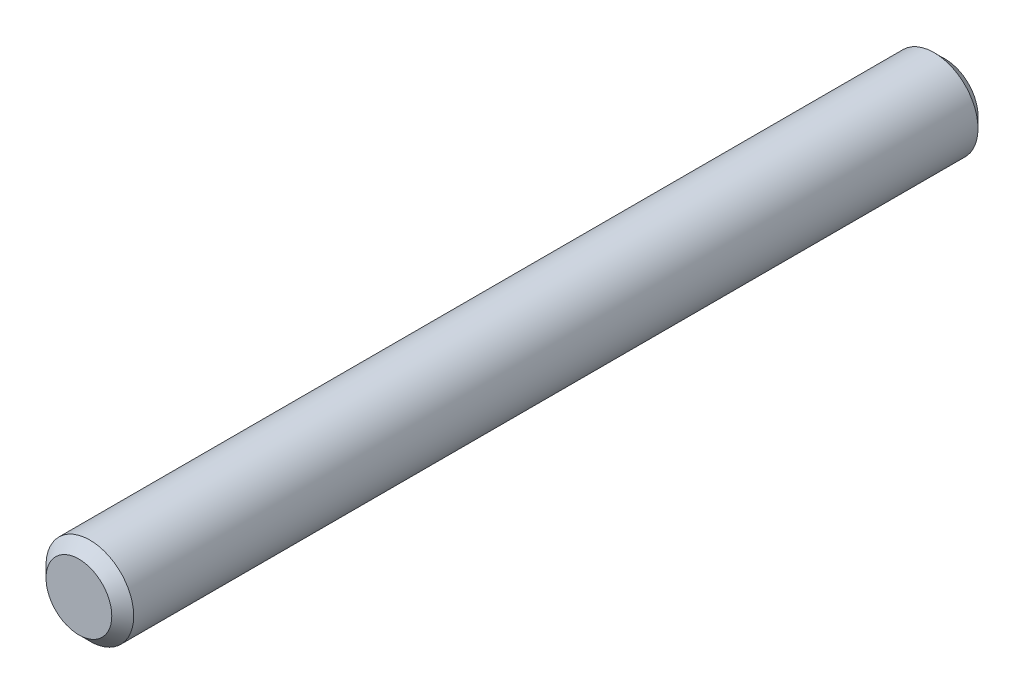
ISO-10303-21;
HEADER;
FILE_DESCRIPTION(('STEP AP214'),'2;1');
FILE_NAME('part.step','',(''),(''),'','','');
FILE_SCHEMA(('AUTOMOTIVE_DESIGN { 1 0 10303 214 1 1 1 1 }'));
ENDSEC;
DATA;
#1=APPLICATION_CONTEXT('core data for automotive mechanical design processes');
#2=APPLICATION_PROTOCOL_DEFINITION('international standard','automotive_design',2000,#1);
#3=PRODUCT_CONTEXT('',#1,'mechanical');
#4=PRODUCT('Part','Part','',(#3));
#5=PRODUCT_RELATED_PRODUCT_CATEGORY('part','',(#4));
#6=PRODUCT_DEFINITION_FORMATION('','',#4);
#7=PRODUCT_DEFINITION_CONTEXT('part definition',#1,'design');
#8=PRODUCT_DEFINITION('design','',#6,#7);
#9=PRODUCT_DEFINITION_SHAPE('','',#8);
#10=(LENGTH_UNIT() NAMED_UNIT(*) SI_UNIT(.MILLI.,.METRE.));
#11=(NAMED_UNIT(*) PLANE_ANGLE_UNIT() SI_UNIT($,.RADIAN.));
#12=(NAMED_UNIT(*) SI_UNIT($,.STERADIAN.) SOLID_ANGLE_UNIT());
#13=UNCERTAINTY_MEASURE_WITH_UNIT(LENGTH_MEASURE(1.E-05),#10,'distance_accuracy_value','');
#14=(GEOMETRIC_REPRESENTATION_CONTEXT(3) GLOBAL_UNCERTAINTY_ASSIGNED_CONTEXT((#13)) GLOBAL_UNIT_ASSIGNED_CONTEXT((#10,
#11,#12)) REPRESENTATION_CONTEXT('',''));
#15=CARTESIAN_POINT('',(0.,0.,0.));
#16=DIRECTION('',(0.,0.,1.));
#17=DIRECTION('',(1.,0.,0.));
#18=AXIS2_PLACEMENT_3D('',#15,#16,#17);
#19=CARTESIAN_POINT('',(16.875,12.7283573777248,17.6));
#20=DIRECTION('',(0.,0.,-1.));
#21=DIRECTION('',(-1.,0.,0.));
#22=AXIS2_PLACEMENT_3D('',#19,#20,#21);
#23=CYLINDRICAL_SURFACE('',#22,1.);
#24=CARTESIAN_POINT('',(16.875,12.7283573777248,17.35));
#25=DIRECTION('',(0.,0.,1.));
#26=DIRECTION('',(1.,0.,0.));
#27=AXIS2_PLACEMENT_3D('',#24,#25,#26);
#28=CIRCLE('',#27,1.);
#29=CARTESIAN_POINT('',(17.875,12.7283573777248,17.35));
#30=VERTEX_POINT('',#29);
#31=EDGE_CURVE('E33',#30,#30,#28,.F.);
#32=ORIENTED_EDGE('',*,*,#31,.T.);
#33=EDGE_LOOP('',(#32));
#34=FACE_BOUND('',#33,.T.);
#35=CARTESIAN_POINT('',(16.875,12.7283573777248,-1.9));
#36=DIRECTION('',(0.,0.,1.));
#37=DIRECTION('',(1.,0.,0.));
#38=AXIS2_PLACEMENT_3D('',#35,#36,#37);
#39=CIRCLE('',#38,1.);
#40=CARTESIAN_POINT('',(17.875,12.7283573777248,-1.9));
#41=VERTEX_POINT('',#40);
#42=EDGE_CURVE('E37',#41,#41,#39,.T.);
#43=ORIENTED_EDGE('',*,*,#42,.T.);
#44=EDGE_LOOP('',(#43));
#45=FACE_BOUND('',#44,.T.);
#46=ADVANCED_FACE('F27',(#34,#45),#23,.T.);
#47=CARTESIAN_POINT('',(16.875,12.7283573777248,17.6));
#48=DIRECTION('',(0.,0.,1.));
#49=DIRECTION('',(1.,0.,0.));
#50=AXIS2_PLACEMENT_3D('',#47,#48,#49);
#51=PLANE('',#50);
#52=CARTESIAN_POINT('',(16.875,12.7283573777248,17.6));
#53=DIRECTION('',(0.,0.,1.));
#54=DIRECTION('',(1.,0.,0.));
#55=AXIS2_PLACEMENT_3D('',#52,#53,#54);
#56=CIRCLE('',#55,0.750000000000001);
#57=CARTESIAN_POINT('',(17.625,12.7283573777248,17.6));
#58=VERTEX_POINT('',#57);
#59=EDGE_CURVE('E41',#58,#58,#56,.T.);
#60=ORIENTED_EDGE('',*,*,#59,.T.);
#61=EDGE_LOOP('',(#60));
#62=FACE_BOUND('',#61,.T.);
#63=ADVANCED_FACE('F47',(#62),#51,.T.);
#64=CARTESIAN_POINT('',(16.875,12.7283573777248,-2.15));
#65=DIRECTION('',(0.,0.,1.));
#66=DIRECTION('',(1.,0.,0.));
#67=AXIS2_PLACEMENT_3D('',#64,#65,#66);
#68=PLANE('',#67);
#69=CARTESIAN_POINT('',(16.875,12.7283573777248,-2.15));
#70=DIRECTION('',(0.,0.,1.));
#71=DIRECTION('',(1.,0.,0.));
#72=AXIS2_PLACEMENT_3D('',#69,#70,#71);
#73=CIRCLE('',#72,0.750000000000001);
#74=CARTESIAN_POINT('',(17.625,12.7283573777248,-2.15));
#75=VERTEX_POINT('',#74);
#76=EDGE_CURVE('E10',#75,#75,#73,.F.);
#77=ORIENTED_EDGE('',*,*,#76,.T.);
#78=EDGE_LOOP('',(#77));
#79=FACE_BOUND('',#78,.T.);
#80=ADVANCED_FACE('F52',(#79),#68,.F.);
#81=CARTESIAN_POINT('',(16.875,12.7283573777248,17.6));
#82=DIRECTION('',(0.,0.,-1.));
#83=DIRECTION('',(-1.,0.,0.));
#84=AXIS2_PLACEMENT_3D('',#81,#82,#83);
#85=CONICAL_SURFACE('',#84,0.750000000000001,0.78539816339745);
#86=ORIENTED_EDGE('',*,*,#31,.F.);
#87=EDGE_LOOP('',(#86));
#88=FACE_BOUND('',#87,.T.);
#89=ORIENTED_EDGE('',*,*,#59,.F.);
#90=EDGE_LOOP('',(#89));
#91=FACE_BOUND('',#90,.T.);
#92=ADVANCED_FACE('F49',(#88,#91),#85,.T.);
#93=CARTESIAN_POINT('',(16.875,12.7283573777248,-1.9));
#94=DIRECTION('',(0.,0.,1.));
#95=DIRECTION('',(1.,0.,0.));
#96=AXIS2_PLACEMENT_3D('',#93,#94,#95);
#97=CONICAL_SURFACE('',#96,1.,0.78539816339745);
#98=ORIENTED_EDGE('',*,*,#76,.F.);
#99=EDGE_LOOP('',(#98));
#100=FACE_BOUND('',#99,.T.);
#101=ORIENTED_EDGE('',*,*,#42,.F.);
#102=EDGE_LOOP('',(#101));
#103=FACE_BOUND('',#102,.T.);
#104=ADVANCED_FACE('F51',(#100,#103),#97,.T.);
#105=CLOSED_SHELL('',(#46,#63,#80,#92,#104));
#106=MANIFOLD_SOLID_BREP('B2',#105);
#107=ADVANCED_BREP_SHAPE_REPRESENTATION('',(#18,#106),#14);
#108=SHAPE_DEFINITION_REPRESENTATION(#9,#107);
ENDSEC;
END-ISO-10303-21;
